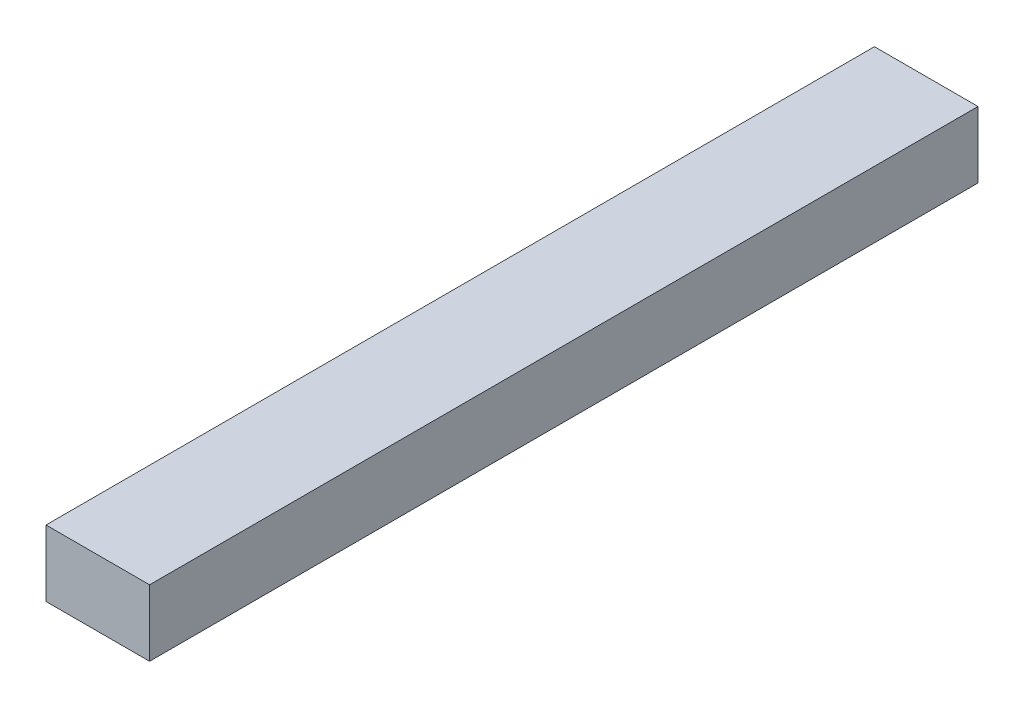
from build123d import *

# Parameters (mm, degrees)
CROQUIS1_W           = 55
CROQUIS1_H           = 35
EXTRUIR1_DEPTH       = 200
CEPILLADO_DEPTH      = 203.638841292
CEPILLADO_DEPTH_BACK = 203.638841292
CROQUIS2_W           = 55
CROQUIS2_H           = 35
CROQUIS2_W_2         = 50
CROQUIS2_H_2         = 32


with BuildPart() as part:
    # Croquis1 → Extruir1 (new, symmetric)
    with BuildSketch(Plane.XY):
        Rectangle(CROQUIS1_W, CROQUIS1_H)
    extrude(amount=EXTRUIR1_DEPTH, both=True)

    # Croquis2 → Cepillado (cut, two sides: drawn at the far end of the back side and taken through both)
    with BuildSketch(Plane.XY.offset(-CEPILLADO_DEPTH_BACK)):
        Rectangle(CROQUIS2_W, CROQUIS2_H)
        Rectangle(CROQUIS2_W_2, CROQUIS2_H_2, mode=Mode.SUBTRACT)
    extrude(amount=CEPILLADO_DEPTH + CEPILLADO_DEPTH_BACK, mode=Mode.SUBTRACT)


solid = part.part
